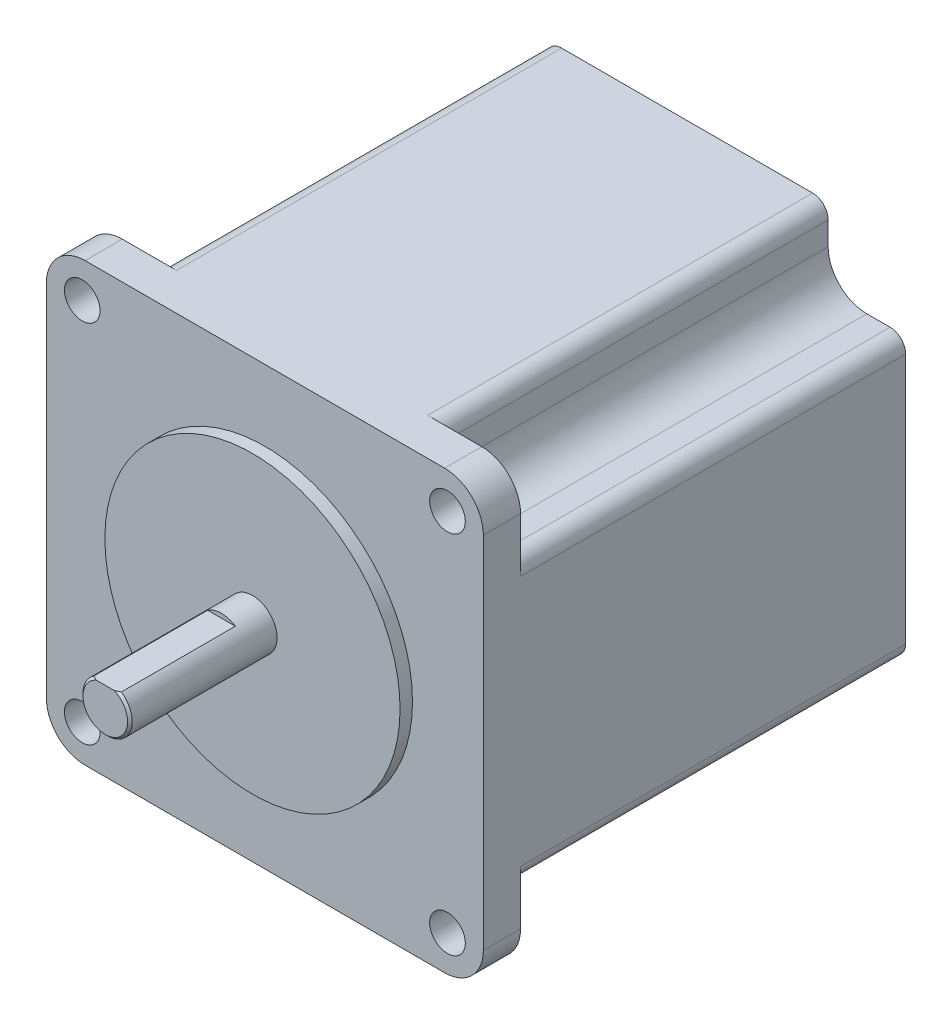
from build123d import *

# Parameters (mm, degrees)
SKETCH_1_R          = 19.05
EXTRUDE_1_DEPTH     = 1.6
SKETCH_2_R          = 3.175
EXTRUDE_2_DEPTH     = 19
CUT_EXTRUDE_1_DEPTH = 15
EXTRUDE_3_DEPTH     = 54.5
CUT_EXTRUDE_START   = -49.7
CUT_EXTRUDE_2_DEPTH = 49.7
SKETCH_6_R          = 2.3
CUT_EXTRUDE_3_DEPTH = 49.7
CHAMFER_1_SIZE      = 0.3


with BuildPart() as part:
    # Sketch 1 → Extrude 1 (new body)
    with BuildSketch(Plane.XY):
        Circle(SKETCH_1_R)
    extrude(amount=-EXTRUDE_1_DEPTH)

    # Sketch 2 → Extrude 2 (add)
    with BuildSketch(Plane.XY):
        Circle(SKETCH_2_R)
    extrude(amount=EXTRUDE_2_DEPTH)

    # Sketch 3 → Cut-Extrude 1 (cut)
    with BuildSketch(Plane.XY.offset(19)):
        Polygon((0, 2.625), (4.154448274, 2.625), (4.154448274, 5.019958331), (-4.599567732, 5.019958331), (-4.599567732, 2.625), align=None)
    extrude(amount=-CUT_EXTRUDE_1_DEPTH, mode=Mode.SUBTRACT)

    # Sketch 4 → Extrude 3 (add)
    with BuildSketch(Plane(origin=(0, 0, -1.6), x_dir=(-1, 0, 0), z_dir=(0, 0, -1))):
        with BuildLine():
            Line((0, 28.2), (23.2, 28.2))
            ThreePointArc((23.2, 28.2), (26.735533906, 26.735533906), (28.2, 23.2))
            Line((28.2, 23.2), (28.2, -23.2))
            ThreePointArc((28.2, -23.2), (26.735533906, -26.735533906), (23.2, -28.2))
            Line((23.2, -28.2), (-23.2, -28.2))
            ThreePointArc((-23.2, -28.2), (-26.735533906, -26.735533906), (-28.2, -23.2))
            Line((-28.2, -23.2), (-28.2, 23.2))
            ThreePointArc((-28.2, 23.2), (-26.735533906, 26.735533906), (-23.2, 28.2))
            Line((-23.2, 28.2), (0, 28.2))
        make_face()
    extrude(amount=EXTRUDE_3_DEPTH)

    # Sketch 5 → Cut-Extrude 2 (cut)
    with BuildSketch(Plane(origin=(0, 0, -56.1), x_dir=(-1, 0, 0), z_dir=(0, 0, -1)).offset(CUT_EXTRUDE_START)):
        with BuildLine():
            Line((11.494440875, 28.2), (16.2, 28.2))
            ThreePointArc((16.2, 28.2), (17.614213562, 27.614213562), (18.2, 26.2))
            Line((18.2, 26.2), (18.2, 23.2))
            ThreePointArc((18.2, 23.2), (19.664466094, 19.664466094), (23.2, 18.2))
            Line((23.2, 18.2), (26.2, 18.2))
            ThreePointArc((26.2, 18.2), (27.614213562, 17.614213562), (28.2, 16.2))
            Line((28.2, 16.2), (28.2, 9.920361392))
            Line((28.2, 9.920361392), (36.460073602, 9.920361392))
            Line((36.460073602, 9.920361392), (36.460073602, 32.177113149))
            Line((36.460073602, 32.177113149), (11.494440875, 32.177113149))
            Line((11.494440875, 32.177113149), (11.494440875, 28.2))
        make_face()
        with BuildLine():
            Line((-11.494440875, 32.177113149), (-11.494440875, 28.2))
            Line((-11.494440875, 28.2), (-16.2, 28.2))
            ThreePointArc((-16.2, 28.2), (-17.614213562, 27.614213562), (-18.2, 26.2))
            Line((-18.2, 26.2), (-18.2, 23.2))
            ThreePointArc((-18.2, 23.2), (-19.664466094, 19.664466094), (-23.2, 18.2))
            Line((-23.2, 18.2), (-26.2, 18.2))
            ThreePointArc((-26.2, 18.2), (-27.614213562, 17.614213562), (-28.2, 16.2))
            Line((-28.2, 16.2), (-28.2, 9.920361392))
            Line((-28.2, 9.920361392), (-36.460073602, 9.920361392))
            Line((-36.460073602, 9.920361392), (-36.460073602, 32.177113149))
            Line((-36.460073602, 32.177113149), (-11.494440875, 32.177113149))
        make_face()
        with BuildLine():
            Line((11.494440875, -32.177113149), (11.494440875, -28.2))
            Line((11.494440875, -28.2), (16.2, -28.2))
            ThreePointArc((16.2, -28.2), (17.614213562, -27.614213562), (18.2, -26.2))
            Line((18.2, -26.2), (18.2, -23.2))
            ThreePointArc((18.2, -23.2), (19.664466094, -19.664466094), (23.2, -18.2))
            Line((23.2, -18.2), (26.2, -18.2))
            ThreePointArc((26.2, -18.2), (27.614213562, -17.614213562), (28.2, -16.2))
            Line((28.2, -16.2), (28.2, -9.920361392))
            Line((28.2, -9.920361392), (36.460073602, -9.920361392))
            Line((36.460073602, -9.920361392), (36.460073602, -32.177113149))
            Line((36.460073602, -32.177113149), (11.494440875, -32.177113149))
        make_face()
        with BuildLine():
            Line((-11.494440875, -28.2), (-16.2, -28.2))
            ThreePointArc((-16.2, -28.2), (-17.614213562, -27.614213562), (-18.2, -26.2))
            Line((-18.2, -26.2), (-18.2, -23.2))
            ThreePointArc((-18.2, -23.2), (-19.664466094, -19.664466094), (-23.2, -18.2))
            Line((-23.2, -18.2), (-26.2, -18.2))
            ThreePointArc((-26.2, -18.2), (-27.614213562, -17.614213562), (-28.2, -16.2))
            Line((-28.2, -16.2), (-28.2, -9.920361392))
            Line((-28.2, -9.920361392), (-36.460073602, -9.920361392))
            Line((-36.460073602, -9.920361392), (-36.460073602, -32.177113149))
            Line((-36.460073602, -32.177113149), (-11.494440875, -32.177113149))
            Line((-11.494440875, -32.177113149), (-11.494440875, -28.2))
        make_face()
    extrude(amount=CUT_EXTRUDE_2_DEPTH, mode=Mode.SUBTRACT)

    # Sketch 6 → Cut-Extrude 3 (cut)
    with BuildSketch(Plane.XY.offset(-1.6)):
        with Locations((-23.57, 23.57)):
            Circle(SKETCH_6_R)
        with Locations((23.57, 23.57)):
            Circle(SKETCH_6_R)
        with Locations((23.57, -23.57)):
            Circle(SKETCH_6_R)
        with Locations((-23.57, -23.57)):
            Circle(SKETCH_6_R)
    extrude(amount=-CUT_EXTRUDE_3_DEPTH, mode=Mode.SUBTRACT)

    # Chamfer 1
    chamfer_1_edges = [part.edges().sort_by_distance(p)[0] for p in [
        (-1.48490634, -2.806363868, 19),
    ]]
    chamfer(chamfer_1_edges, length=CHAMFER_1_SIZE)


solid = part.part
